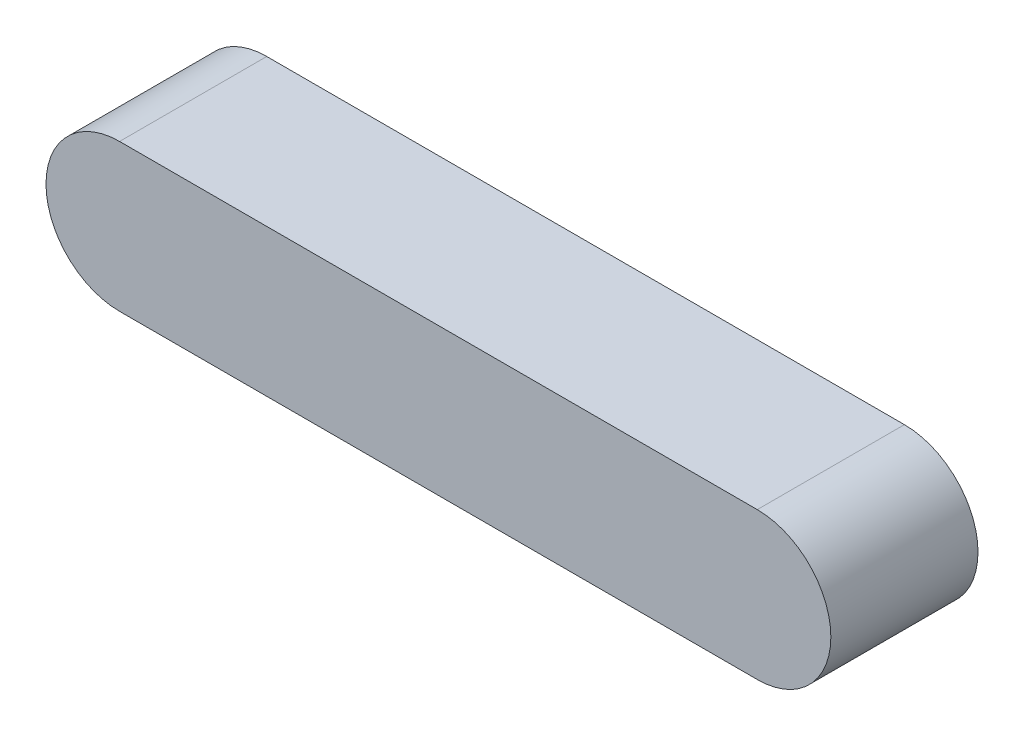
ISO-10303-21;
HEADER;
FILE_DESCRIPTION(('STEP AP214'),'2;1');
FILE_NAME('part.step','',(''),(''),'','','');
FILE_SCHEMA(('AUTOMOTIVE_DESIGN { 1 0 10303 214 1 1 1 1 }'));
ENDSEC;
DATA;
#1=APPLICATION_CONTEXT('core data for automotive mechanical design processes');
#2=APPLICATION_PROTOCOL_DEFINITION('international standard','automotive_design',2000,#1);
#3=PRODUCT_CONTEXT('',#1,'mechanical');
#4=PRODUCT('Part','Part','',(#3));
#5=PRODUCT_RELATED_PRODUCT_CATEGORY('part','',(#4));
#6=PRODUCT_DEFINITION_FORMATION('','',#4);
#7=PRODUCT_DEFINITION_CONTEXT('part definition',#1,'design');
#8=PRODUCT_DEFINITION('design','',#6,#7);
#9=PRODUCT_DEFINITION_SHAPE('','',#8);
#10=(LENGTH_UNIT() NAMED_UNIT(*) SI_UNIT(.MILLI.,.METRE.));
#11=(NAMED_UNIT(*) PLANE_ANGLE_UNIT() SI_UNIT($,.RADIAN.));
#12=(NAMED_UNIT(*) SI_UNIT($,.STERADIAN.) SOLID_ANGLE_UNIT());
#13=UNCERTAINTY_MEASURE_WITH_UNIT(LENGTH_MEASURE(1.E-05),#10,'distance_accuracy_value','');
#14=(GEOMETRIC_REPRESENTATION_CONTEXT(3) GLOBAL_UNCERTAINTY_ASSIGNED_CONTEXT((#13)) GLOBAL_UNIT_ASSIGNED_CONTEXT((#10,
#11,#12)) REPRESENTATION_CONTEXT('',''));
#15=CARTESIAN_POINT('',(0.,0.,0.));
#16=DIRECTION('',(0.,0.,1.));
#17=DIRECTION('',(1.,0.,0.));
#18=AXIS2_PLACEMENT_3D('',#15,#16,#17);
#19=CARTESIAN_POINT('',(8.,0.,-1.8));
#20=DIRECTION('',(0.,0.,1.));
#21=DIRECTION('',(1.,0.,0.));
#22=AXIS2_PLACEMENT_3D('',#19,#20,#21);
#23=PLANE('',#22);
#24=DIRECTION('',(1.,0.,0.));
#25=VECTOR('',#24,1.);
#26=CARTESIAN_POINT('',(14.5,1.5,-1.8));
#27=LINE('',#26,#25);
#28=CARTESIAN_POINT('',(14.5,1.5,-1.8));
#29=VERTEX_POINT('',#28);
#30=CARTESIAN_POINT('',(1.5,1.5,-1.8));
#31=VERTEX_POINT('',#30);
#32=EDGE_CURVE('E58',#29,#31,#27,.F.);
#33=ORIENTED_EDGE('',*,*,#32,.F.);
#34=CARTESIAN_POINT('',(14.5,0.,-1.8));
#35=DIRECTION('',(0.,0.,-1.));
#36=DIRECTION('',(-1.,0.,0.));
#37=AXIS2_PLACEMENT_3D('',#34,#35,#36);
#38=CIRCLE('',#37,1.5);
#39=CARTESIAN_POINT('',(14.5,-1.5,-1.8));
#40=VERTEX_POINT('',#39);
#41=EDGE_CURVE('E74',#40,#29,#38,.F.);
#42=ORIENTED_EDGE('',*,*,#41,.F.);
#43=DIRECTION('',(1.,0.,0.));
#44=VECTOR('',#43,1.);
#45=CARTESIAN_POINT('',(1.5,-1.5,-1.8));
#46=LINE('',#45,#44);
#47=CARTESIAN_POINT('',(1.5,-1.5,-1.8));
#48=VERTEX_POINT('',#47);
#49=EDGE_CURVE('E60',#48,#40,#46,.T.);
#50=ORIENTED_EDGE('',*,*,#49,.F.);
#51=CARTESIAN_POINT('',(1.5,0.,-1.8));
#52=DIRECTION('',(0.,0.,-1.));
#53=DIRECTION('',(-1.,0.,0.));
#54=AXIS2_PLACEMENT_3D('',#51,#52,#53);
#55=CIRCLE('',#54,1.5);
#56=EDGE_CURVE('E20',#31,#48,#55,.F.);
#57=ORIENTED_EDGE('',*,*,#56,.F.);
#58=EDGE_LOOP('',(#33,#42,#50,#57));
#59=FACE_BOUND('',#58,.T.);
#60=ADVANCED_FACE('F16',(#59),#23,.F.);
#61=CARTESIAN_POINT('',(1.5,0.,0.));
#62=DIRECTION('',(0.,0.,-1.));
#63=DIRECTION('',(-1.,0.,0.));
#64=AXIS2_PLACEMENT_3D('',#61,#62,#63);
#65=CYLINDRICAL_SURFACE('',#64,1.5);
#66=CARTESIAN_POINT('',(1.5,0.,1.2));
#67=DIRECTION('',(0.,0.,-1.));
#68=DIRECTION('',(-1.,0.,0.));
#69=AXIS2_PLACEMENT_3D('',#66,#67,#68);
#70=CIRCLE('',#69,1.5);
#71=CARTESIAN_POINT('',(1.5,1.5,1.2));
#72=VERTEX_POINT('',#71);
#73=CARTESIAN_POINT('',(1.5,-1.5,1.2));
#74=VERTEX_POINT('',#73);
#75=EDGE_CURVE('E67',#72,#74,#70,.F.);
#76=ORIENTED_EDGE('',*,*,#75,.F.);
#77=DIRECTION('',(0.,0.,1.));
#78=VECTOR('',#77,1.);
#79=CARTESIAN_POINT('',(1.5,1.5,0.));
#80=LINE('',#79,#78);
#81=EDGE_CURVE('E64',#31,#72,#80,.T.);
#82=ORIENTED_EDGE('',*,*,#81,.F.);
#83=ORIENTED_EDGE('',*,*,#56,.T.);
#84=DIRECTION('',(0.,0.,1.));
#85=VECTOR('',#84,1.);
#86=CARTESIAN_POINT('',(1.5,-1.5,0.));
#87=LINE('',#86,#85);
#88=EDGE_CURVE('E78',#74,#48,#87,.F.);
#89=ORIENTED_EDGE('',*,*,#88,.F.);
#90=EDGE_LOOP('',(#76,#82,#83,#89));
#91=FACE_BOUND('',#90,.T.);
#92=ADVANCED_FACE('F65',(#91),#65,.T.);
#93=CARTESIAN_POINT('',(1.5,-1.5,0.));
#94=DIRECTION('',(0.,-1.,0.));
#95=DIRECTION('',(1.,0.,0.));
#96=AXIS2_PLACEMENT_3D('',#93,#94,#95);
#97=PLANE('',#96);
#98=DIRECTION('',(1.,0.,0.));
#99=VECTOR('',#98,1.);
#100=CARTESIAN_POINT('',(8.,-1.5,1.2));
#101=LINE('',#100,#99);
#102=CARTESIAN_POINT('',(14.5,-1.5,1.2));
#103=VERTEX_POINT('',#102);
#104=EDGE_CURVE('E82',#74,#103,#101,.T.);
#105=ORIENTED_EDGE('',*,*,#104,.F.);
#106=ORIENTED_EDGE('',*,*,#88,.T.);
#107=ORIENTED_EDGE('',*,*,#49,.T.);
#108=DIRECTION('',(0.,0.,-1.));
#109=VECTOR('',#108,1.);
#110=CARTESIAN_POINT('',(14.5,-1.5,0.));
#111=LINE('',#110,#109);
#112=EDGE_CURVE('E71',#103,#40,#111,.T.);
#113=ORIENTED_EDGE('',*,*,#112,.F.);
#114=EDGE_LOOP('',(#105,#106,#107,#113));
#115=FACE_BOUND('',#114,.T.);
#116=ADVANCED_FACE('F85',(#115),#97,.T.);
#117=CARTESIAN_POINT('',(14.5,0.,0.));
#118=DIRECTION('',(0.,0.,-1.));
#119=DIRECTION('',(-1.,0.,0.));
#120=AXIS2_PLACEMENT_3D('',#117,#118,#119);
#121=CYLINDRICAL_SURFACE('',#120,1.5);
#122=CARTESIAN_POINT('',(14.5,0.,1.2));
#123=DIRECTION('',(0.,0.,-1.));
#124=DIRECTION('',(-1.,0.,0.));
#125=AXIS2_PLACEMENT_3D('',#122,#123,#124);
#126=CIRCLE('',#125,1.5);
#127=CARTESIAN_POINT('',(14.5,1.5,1.2));
#128=VERTEX_POINT('',#127);
#129=EDGE_CURVE('E26',#103,#128,#126,.F.);
#130=ORIENTED_EDGE('',*,*,#129,.F.);
#131=ORIENTED_EDGE('',*,*,#112,.T.);
#132=ORIENTED_EDGE('',*,*,#41,.T.);
#133=DIRECTION('',(0.,0.,1.));
#134=VECTOR('',#133,1.);
#135=CARTESIAN_POINT('',(14.5,1.5,0.));
#136=LINE('',#135,#134);
#137=EDGE_CURVE('E35',#128,#29,#136,.F.);
#138=ORIENTED_EDGE('',*,*,#137,.F.);
#139=EDGE_LOOP('',(#130,#131,#132,#138));
#140=FACE_BOUND('',#139,.T.);
#141=ADVANCED_FACE('F89',(#140),#121,.T.);
#142=CARTESIAN_POINT('',(14.5,1.5,0.));
#143=DIRECTION('',(0.,1.,0.));
#144=DIRECTION('',(0.,0.,1.));
#145=AXIS2_PLACEMENT_3D('',#142,#143,#144);
#146=PLANE('',#145);
#147=DIRECTION('',(1.,0.,0.));
#148=VECTOR('',#147,1.);
#149=CARTESIAN_POINT('',(8.,1.5,1.2));
#150=LINE('',#149,#148);
#151=EDGE_CURVE('E10',#128,#72,#150,.F.);
#152=ORIENTED_EDGE('',*,*,#151,.F.);
#153=ORIENTED_EDGE('',*,*,#137,.T.);
#154=ORIENTED_EDGE('',*,*,#32,.T.);
#155=ORIENTED_EDGE('',*,*,#81,.T.);
#156=EDGE_LOOP('',(#152,#153,#154,#155));
#157=FACE_BOUND('',#156,.T.);
#158=ADVANCED_FACE('F70',(#157),#146,.T.);
#159=CARTESIAN_POINT('',(8.,0.,1.2));
#160=DIRECTION('',(0.,0.,1.));
#161=DIRECTION('',(1.,0.,0.));
#162=AXIS2_PLACEMENT_3D('',#159,#160,#161);
#163=PLANE('',#162);
#164=ORIENTED_EDGE('',*,*,#129,.T.);
#165=ORIENTED_EDGE('',*,*,#151,.T.);
#166=ORIENTED_EDGE('',*,*,#75,.T.);
#167=ORIENTED_EDGE('',*,*,#104,.T.);
#168=EDGE_LOOP('',(#164,#165,#166,#167));
#169=FACE_BOUND('',#168,.T.);
#170=ADVANCED_FACE('F18',(#169),#163,.T.);
#171=CLOSED_SHELL('',(#60,#92,#116,#141,#158,#170));
#172=MANIFOLD_SOLID_BREP('B1',#171);
#173=ADVANCED_BREP_SHAPE_REPRESENTATION('',(#18,#172),#14);
#174=SHAPE_DEFINITION_REPRESENTATION(#9,#173);
ENDSEC;
END-ISO-10303-21;
